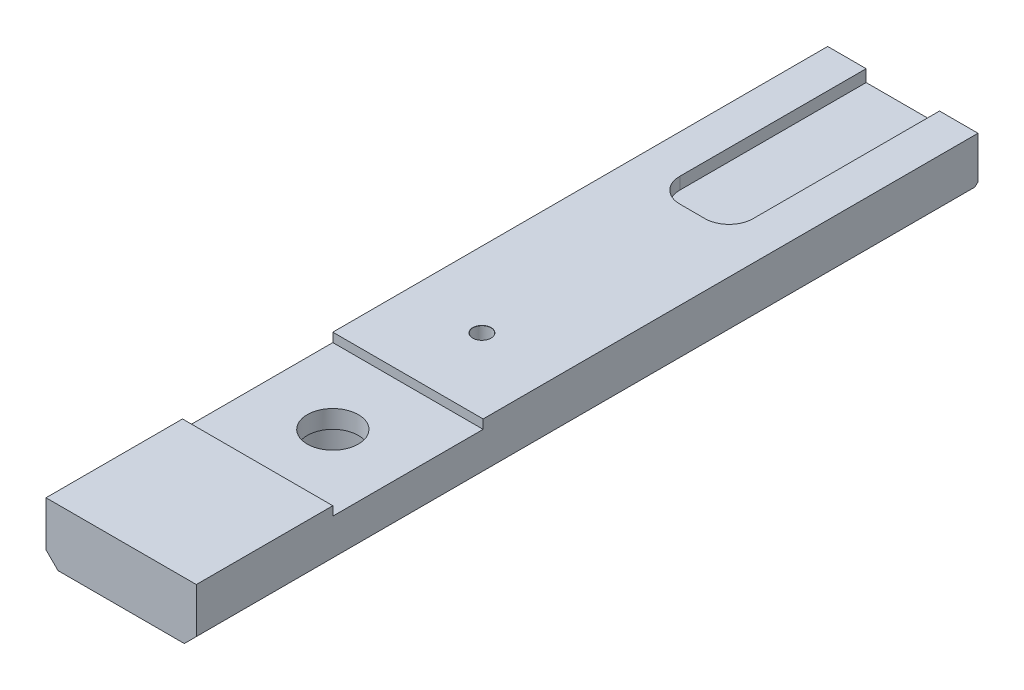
ISO-10303-21;
HEADER;
FILE_DESCRIPTION(('STEP AP214'),'2;1');
FILE_NAME('part.step','',(''),(''),'','','');
FILE_SCHEMA(('AUTOMOTIVE_DESIGN { 1 0 10303 214 1 1 1 1 }'));
ENDSEC;
DATA;
#1=APPLICATION_CONTEXT('core data for automotive mechanical design processes');
#2=APPLICATION_PROTOCOL_DEFINITION('international standard','automotive_design',2000,#1);
#3=PRODUCT_CONTEXT('',#1,'mechanical');
#4=PRODUCT('Part','Part','',(#3));
#5=PRODUCT_RELATED_PRODUCT_CATEGORY('part','',(#4));
#6=PRODUCT_DEFINITION_FORMATION('','',#4);
#7=PRODUCT_DEFINITION_CONTEXT('part definition',#1,'design');
#8=PRODUCT_DEFINITION('design','',#6,#7);
#9=PRODUCT_DEFINITION_SHAPE('','',#8);
#10=(LENGTH_UNIT() NAMED_UNIT(*) SI_UNIT(.MILLI.,.METRE.));
#11=(NAMED_UNIT(*) PLANE_ANGLE_UNIT() SI_UNIT($,.RADIAN.));
#12=(NAMED_UNIT(*) SI_UNIT($,.STERADIAN.) SOLID_ANGLE_UNIT());
#13=UNCERTAINTY_MEASURE_WITH_UNIT(LENGTH_MEASURE(1.E-05),#10,'distance_accuracy_value','');
#14=(GEOMETRIC_REPRESENTATION_CONTEXT(3) GLOBAL_UNCERTAINTY_ASSIGNED_CONTEXT((#13)) GLOBAL_UNIT_ASSIGNED_CONTEXT((#10,
#11,#12)) REPRESENTATION_CONTEXT('',''));
#15=CARTESIAN_POINT('',(0.,0.,0.));
#16=DIRECTION('',(0.,0.,1.));
#17=DIRECTION('',(1.,0.,0.));
#18=AXIS2_PLACEMENT_3D('',#15,#16,#17);
#19=CARTESIAN_POINT('',(-6.09999999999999,0.,130.));
#20=DIRECTION('',(-1.,0.,0.));
#21=DIRECTION('',(0.,0.,1.));
#22=AXIS2_PLACEMENT_3D('',#19,#20,#21);
#23=PLANE('',#22);
#24=DIRECTION('',(0.,0.,-1.));
#25=VECTOR('',#24,1.);
#26=CARTESIAN_POINT('',(-6.09999999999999,1.5,130.));
#27=LINE('',#26,#25);
#28=CARTESIAN_POINT('',(-6.10000000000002,1.49999999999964,91.3663430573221));
#29=VERTEX_POINT('',#28);
#30=CARTESIAN_POINT('',(-6.09999999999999,1.5,3.));
#31=VERTEX_POINT('',#30);
#32=EDGE_CURVE('E464',#29,#31,#27,.T.);
#33=ORIENTED_EDGE('',*,*,#32,.F.);
#34=DIRECTION('',(0.,-1.,0.));
#35=VECTOR('',#34,1.);
#36=CARTESIAN_POINT('',(-6.10000000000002,6.99999999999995,91.3663430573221));
#37=LINE('',#36,#35);
#38=CARTESIAN_POINT('',(-6.10000000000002,0.499999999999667,91.3663430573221));
#39=VERTEX_POINT('',#38);
#40=EDGE_CURVE('E313',#29,#39,#37,.T.);
#41=ORIENTED_EDGE('',*,*,#40,.T.);
#42=DIRECTION('',(0.,0.,-1.));
#43=VECTOR('',#42,1.);
#44=CARTESIAN_POINT('',(-6.09999999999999,0.5,130.));
#45=LINE('',#44,#43);
#46=CARTESIAN_POINT('',(-6.09999999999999,0.500000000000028,3.99999999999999));
#47=VERTEX_POINT('',#46);
#48=EDGE_CURVE('E469',#39,#47,#45,.T.);
#49=ORIENTED_EDGE('',*,*,#48,.T.);
#50=DIRECTION('',(0.,0.707106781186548,-0.707106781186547));
#51=VECTOR('',#50,1.);
#52=CARTESIAN_POINT('',(-6.10000000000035,-62.75,67.25));
#53=LINE('',#52,#51);
#54=EDGE_CURVE('E369',#47,#31,#53,.T.);
#55=ORIENTED_EDGE('',*,*,#54,.T.);
#56=EDGE_LOOP('',(#33,#41,#49,#55));
#57=FACE_BOUND('',#56,.T.);
#58=ADVANCED_FACE('F44',(#57),#23,.F.);
#59=CARTESIAN_POINT('',(-6.09999999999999,1.5,130.));
#60=DIRECTION('',(0.,1.,0.));
#61=DIRECTION('',(-1.,0.,0.));
#62=AXIS2_PLACEMENT_3D('',#59,#60,#61);
#63=PLANE('',#62);
#64=CARTESIAN_POINT('',(-6.09999999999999,1.5,129.5));
#65=VERTEX_POINT('',#64);
#66=CARTESIAN_POINT('',(-6.10000000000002,1.49999999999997,98.2336569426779));
#67=VERTEX_POINT('',#66);
#68=EDGE_CURVE('E465',#65,#67,#27,.T.);
#69=ORIENTED_EDGE('',*,*,#68,.T.);
#70=CARTESIAN_POINT('',(0.,1.49999999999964,94.8));
#71=DIRECTION('',(0.,1.,0.));
#72=DIRECTION('',(-1.,0.,0.));
#73=AXIS2_PLACEMENT_3D('',#70,#71,#72);
#74=CIRCLE('',#73,7.00000000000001);
#75=CARTESIAN_POINT('',(6.09999999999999,1.49999999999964,98.2336569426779));
#76=VERTEX_POINT('',#75);
#77=EDGE_CURVE('E314',#67,#76,#74,.T.);
#78=ORIENTED_EDGE('',*,*,#77,.T.);
#79=DIRECTION('',(0.,0.,-1.));
#80=VECTOR('',#79,1.);
#81=CARTESIAN_POINT('',(6.09999999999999,1.5,130.));
#82=LINE('',#81,#80);
#83=CARTESIAN_POINT('',(6.09999999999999,1.5,129.5));
#84=VERTEX_POINT('',#83);
#85=EDGE_CURVE('E460',#84,#76,#82,.T.);
#86=ORIENTED_EDGE('',*,*,#85,.F.);
#87=DIRECTION('',(-1.,0.,0.));
#88=VECTOR('',#87,1.);
#89=CARTESIAN_POINT('',(-6.09999999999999,1.5,129.5));
#90=LINE('',#89,#88);
#91=EDGE_CURVE('E381',#84,#65,#90,.T.);
#92=ORIENTED_EDGE('',*,*,#91,.T.);
#93=EDGE_LOOP('',(#69,#78,#86,#92));
#94=FACE_BOUND('',#93,.T.);
#95=ADVANCED_FACE('F574',(#94),#63,.F.);
#96=CARTESIAN_POINT('',(6.09999999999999,1.5,130.));
#97=DIRECTION('',(1.,0.,0.));
#98=DIRECTION('',(0.,0.,-1.));
#99=AXIS2_PLACEMENT_3D('',#96,#97,#98);
#100=PLANE('',#99);
#101=ORIENTED_EDGE('',*,*,#85,.T.);
#102=DIRECTION('',(0.,-1.,0.));
#103=VECTOR('',#102,1.);
#104=CARTESIAN_POINT('',(6.09999999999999,6.99999999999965,98.2336569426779));
#105=LINE('',#104,#103);
#106=CARTESIAN_POINT('',(6.09999999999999,0.49999999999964,98.2336569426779));
#107=VERTEX_POINT('',#106);
#108=EDGE_CURVE('E321',#76,#107,#105,.T.);
#109=ORIENTED_EDGE('',*,*,#108,.T.);
#110=DIRECTION('',(0.,0.,1.));
#111=VECTOR('',#110,1.);
#112=CARTESIAN_POINT('',(6.09999999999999,0.5,130.));
#113=LINE('',#112,#111);
#114=CARTESIAN_POINT('',(6.09999999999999,0.5,128.5));
#115=VERTEX_POINT('',#114);
#116=EDGE_CURVE('E484',#107,#115,#113,.T.);
#117=ORIENTED_EDGE('',*,*,#116,.T.);
#118=DIRECTION('',(0.,0.707106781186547,0.707106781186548));
#119=VECTOR('',#118,1.);
#120=CARTESIAN_POINT('',(6.09999999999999,1.75,129.75));
#121=LINE('',#120,#119);
#122=EDGE_CURVE('E377',#115,#84,#121,.T.);
#123=ORIENTED_EDGE('',*,*,#122,.T.);
#124=EDGE_LOOP('',(#101,#109,#117,#123));
#125=FACE_BOUND('',#124,.T.);
#126=ADVANCED_FACE('F581',(#125),#100,.F.);
#127=CARTESIAN_POINT('',(-6.09999999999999,0.5,130.));
#128=DIRECTION('',(-0.707106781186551,0.707106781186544,0.));
#129=DIRECTION('',(-0.707106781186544,-0.707106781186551,0.));
#130=AXIS2_PLACEMENT_3D('',#127,#128,#129);
#131=PLANE('',#130);
#132=CARTESIAN_POINT('',(0.,6.59999999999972,94.8));
#133=DIRECTION('',(-0.707106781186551,0.707106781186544,0.));
#134=DIRECTION('',(-0.707106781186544,-0.707106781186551,0.));
#135=AXIS2_PLACEMENT_3D('',#132,#133,#134);
#136=ELLIPSE('',#135,9.89949493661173,7.00000000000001);
#137=CARTESIAN_POINT('',(-6.60000000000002,-3.60822483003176E-13,92.4676192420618));
#138=VERTEX_POINT('',#137);
#139=EDGE_CURVE('E318',#138,#39,#136,.F.);
#140=ORIENTED_EDGE('',*,*,#139,.F.);
#141=DIRECTION('',(0.,0.,1.));
#142=VECTOR('',#141,1.);
#143=CARTESIAN_POINT('',(-6.59999999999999,0.,130.));
#144=LINE('',#143,#142);
#145=CARTESIAN_POINT('',(-6.59999999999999,0.,4.49999999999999));
#146=VERTEX_POINT('',#145);
#147=EDGE_CURVE('E475',#146,#138,#144,.T.);
#148=ORIENTED_EDGE('',*,*,#147,.F.);
#149=DIRECTION('',(0.577350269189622,0.577350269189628,-0.577350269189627));
#150=VECTOR('',#149,1.);
#151=CARTESIAN_POINT('',(-48.1,-41.500000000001,46.0000000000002));
#152=LINE('',#151,#150);
#153=EDGE_CURVE('E373',#47,#146,#152,.F.);
#154=ORIENTED_EDGE('',*,*,#153,.F.);
#155=ORIENTED_EDGE('',*,*,#48,.F.);
#156=EDGE_LOOP('',(#140,#148,#154,#155));
#157=FACE_BOUND('',#156,.T.);
#158=ADVANCED_FACE('F745',(#157),#131,.F.);
#159=CARTESIAN_POINT('',(6.59999999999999,0.,130.));
#160=DIRECTION('',(0.707106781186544,0.707106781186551,0.));
#161=DIRECTION('',(-0.707106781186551,0.707106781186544,0.));
#162=AXIS2_PLACEMENT_3D('',#159,#160,#161);
#163=PLANE('',#162);
#164=CARTESIAN_POINT('',(0.,6.59999999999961,94.8));
#165=DIRECTION('',(0.707106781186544,0.707106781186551,0.));
#166=DIRECTION('',(0.707106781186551,-0.707106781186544,0.));
#167=AXIS2_PLACEMENT_3D('',#164,#165,#166);
#168=ELLIPSE('',#167,9.89949493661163,7.00000000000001);
#169=CARTESIAN_POINT('',(6.59999999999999,-3.60822483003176E-13,97.1323807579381));
#170=VERTEX_POINT('',#169);
#171=EDGE_CURVE('E501',#170,#107,#168,.F.);
#172=ORIENTED_EDGE('',*,*,#171,.F.);
#173=DIRECTION('',(0.,0.,-1.));
#174=VECTOR('',#173,1.);
#175=CARTESIAN_POINT('',(6.59999999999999,0.,130.));
#176=LINE('',#175,#174);
#177=CARTESIAN_POINT('',(6.59999999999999,0.,128.));
#178=VERTEX_POINT('',#177);
#179=EDGE_CURVE('E480',#178,#170,#176,.T.);
#180=ORIENTED_EDGE('',*,*,#179,.F.);
#181=DIRECTION('',(-0.57735026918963,0.577350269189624,0.577350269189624));
#182=VECTOR('',#181,1.);
#183=CARTESIAN_POINT('',(5.93333333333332,0.666666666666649,128.666666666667));
#184=LINE('',#183,#182);
#185=EDGE_CURVE('E492',#115,#178,#184,.F.);
#186=ORIENTED_EDGE('',*,*,#185,.F.);
#187=ORIENTED_EDGE('',*,*,#116,.F.);
#188=EDGE_LOOP('',(#172,#180,#186,#187));
#189=FACE_BOUND('',#188,.T.);
#190=ADVANCED_FACE('F786',(#189),#163,.F.);
#191=CARTESIAN_POINT('',(0.,-3.60822483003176E-13,94.8));
#192=DIRECTION('',(0.,1.,0.));
#193=DIRECTION('',(0.,0.,1.));
#194=AXIS2_PLACEMENT_3D('',#191,#192,#193);
#195=CYLINDRICAL_SURFACE('',#194,4.25000000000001);
#196=CARTESIAN_POINT('',(0.,10.,94.8));
#197=DIRECTION('',(0.,1.,0.));
#198=DIRECTION('',(0.,0.,1.));
#199=AXIS2_PLACEMENT_3D('',#196,#197,#198);
#200=CIRCLE('',#199,4.25000000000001);
#201=CARTESIAN_POINT('',(0.,10.,99.05));
#202=VERTEX_POINT('',#201);
#203=EDGE_CURVE('E334',#202,#202,#200,.T.);
#204=ORIENTED_EDGE('',*,*,#203,.T.);
#205=EDGE_LOOP('',(#204));
#206=FACE_BOUND('',#205,.T.);
#207=CARTESIAN_POINT('',(0.,6.99999999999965,94.8));
#208=DIRECTION('',(0.,-1.,0.));
#209=DIRECTION('',(0.,0.,-1.));
#210=AXIS2_PLACEMENT_3D('',#207,#208,#209);
#211=CIRCLE('',#210,4.25000000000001);
#212=CARTESIAN_POINT('',(0.,6.99999999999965,90.55));
#213=VERTEX_POINT('',#212);
#214=EDGE_CURVE('E300',#213,#213,#211,.F.);
#215=ORIENTED_EDGE('',*,*,#214,.F.);
#216=EDGE_LOOP('',(#215));
#217=FACE_BOUND('',#216,.T.);
#218=ADVANCED_FACE('F793',(#206,#217),#195,.F.);
#219=CARTESIAN_POINT('',(-12.5,11.5,130.));
#220=DIRECTION('',(0.,-1.,0.));
#221=DIRECTION('',(1.,0.,0.));
#222=AXIS2_PLACEMENT_3D('',#219,#220,#221);
#223=PLANE('',#222);
#224=DIRECTION('',(0.,0.,-1.));
#225=VECTOR('',#224,1.);
#226=CARTESIAN_POINT('',(12.5,11.5,130.));
#227=LINE('',#226,#225);
#228=CARTESIAN_POINT('',(12.5,11.5,130.));
#229=VERTEX_POINT('',#228);
#230=CARTESIAN_POINT('',(12.5,11.5,107.3));
#231=VERTEX_POINT('',#230);
#232=EDGE_CURVE('E455',#229,#231,#227,.T.);
#233=ORIENTED_EDGE('',*,*,#232,.T.);
#234=DIRECTION('',(1.,0.,0.));
#235=VECTOR('',#234,1.);
#236=CARTESIAN_POINT('',(-12.5000000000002,11.5,107.3));
#237=LINE('',#236,#235);
#238=CARTESIAN_POINT('',(-12.5000000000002,11.5,107.3));
#239=VERTEX_POINT('',#238);
#240=EDGE_CURVE('E416',#239,#231,#237,.T.);
#241=ORIENTED_EDGE('',*,*,#240,.F.);
#242=DIRECTION('',(0.,0.,-1.));
#243=VECTOR('',#242,1.);
#244=CARTESIAN_POINT('',(-12.5,11.5,130.));
#245=LINE('',#244,#243);
#246=CARTESIAN_POINT('',(-12.5,11.5,130.));
#247=VERTEX_POINT('',#246);
#248=EDGE_CURVE('E450',#247,#239,#245,.T.);
#249=ORIENTED_EDGE('',*,*,#248,.F.);
#250=DIRECTION('',(-1.,0.,0.));
#251=VECTOR('',#250,1.);
#252=CARTESIAN_POINT('',(-12.5,11.5,130.));
#253=LINE('',#252,#251);
#254=EDGE_CURVE('E437',#229,#247,#253,.T.);
#255=ORIENTED_EDGE('',*,*,#254,.F.);
#256=EDGE_LOOP('',(#233,#241,#249,#255));
#257=FACE_BOUND('',#256,.T.);
#258=ADVANCED_FACE('F756',(#257),#223,.F.);
#259=CARTESIAN_POINT('',(-12.5,0.,130.));
#260=DIRECTION('',(1.,0.,0.));
#261=DIRECTION('',(0.,1.,0.));
#262=AXIS2_PLACEMENT_3D('',#259,#260,#261);
#263=PLANE('',#262);
#264=DIRECTION('',(0.,-0.707106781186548,0.707106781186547));
#265=VECTOR('',#264,1.);
#266=CARTESIAN_POINT('',(-12.5000000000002,4.5,0.));
#267=LINE('',#266,#265);
#268=CARTESIAN_POINT('',(-12.5000000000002,4.5,0.));
#269=VERTEX_POINT('',#268);
#270=CARTESIAN_POINT('',(-12.5000000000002,4.,0.5));
#271=VERTEX_POINT('',#270);
#272=EDGE_CURVE('E348',#269,#271,#267,.T.);
#273=ORIENTED_EDGE('',*,*,#272,.T.);
#274=DIRECTION('',(0.,0.,1.));
#275=VECTOR('',#274,1.);
#276=CARTESIAN_POINT('',(-12.5,4.,130.));
#277=LINE('',#276,#275);
#278=CARTESIAN_POINT('',(-12.5,4.,130.));
#279=VERTEX_POINT('',#278);
#280=EDGE_CURVE('E531',#271,#279,#277,.T.);
#281=ORIENTED_EDGE('',*,*,#280,.T.);
#282=DIRECTION('',(0.,-1.,0.));
#283=VECTOR('',#282,1.);
#284=CARTESIAN_POINT('',(-12.5,0.,130.));
#285=LINE('',#284,#283);
#286=EDGE_CURVE('E429',#247,#279,#285,.T.);
#287=ORIENTED_EDGE('',*,*,#286,.F.);
#288=ORIENTED_EDGE('',*,*,#248,.T.);
#289=DIRECTION('',(0.,-1.,0.));
#290=VECTOR('',#289,1.);
#291=CARTESIAN_POINT('',(-12.5000000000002,11.5,107.3));
#292=LINE('',#291,#290);
#293=CARTESIAN_POINT('',(-12.5000000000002,9.99999999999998,107.3));
#294=VERTEX_POINT('',#293);
#295=EDGE_CURVE('E393',#239,#294,#292,.T.);
#296=ORIENTED_EDGE('',*,*,#295,.T.);
#297=DIRECTION('',(0.,0.,-1.));
#298=VECTOR('',#297,1.);
#299=CARTESIAN_POINT('',(-12.5000000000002,9.99999999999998,107.3));
#300=LINE('',#299,#298);
#301=CARTESIAN_POINT('',(-12.5000000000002,9.99999999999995,82.3));
#302=VERTEX_POINT('',#301);
#303=EDGE_CURVE('E397',#294,#302,#300,.T.);
#304=ORIENTED_EDGE('',*,*,#303,.T.);
#305=DIRECTION('',(0.,1.,0.));
#306=VECTOR('',#305,1.);
#307=CARTESIAN_POINT('',(-12.5000000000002,9.99999999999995,82.3));
#308=LINE('',#307,#306);
#309=CARTESIAN_POINT('',(-12.5000000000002,11.5,82.3));
#310=VERTEX_POINT('',#309);
#311=EDGE_CURVE('E402',#302,#310,#308,.T.);
#312=ORIENTED_EDGE('',*,*,#311,.T.);
#313=CARTESIAN_POINT('',(-12.5000000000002,11.5,0.));
#314=VERTEX_POINT('',#313);
#315=EDGE_CURVE('E440',#310,#314,#245,.T.);
#316=ORIENTED_EDGE('',*,*,#315,.T.);
#317=DIRECTION('',(0.,-1.,0.));
#318=VECTOR('',#317,1.);
#319=CARTESIAN_POINT('',(-12.5000000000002,0.,0.));
#320=LINE('',#319,#318);
#321=EDGE_CURVE('E419',#314,#269,#320,.T.);
#322=ORIENTED_EDGE('',*,*,#321,.T.);
#323=EDGE_LOOP('',(#273,#281,#287,#288,#296,#304,#312,#316,#322));
#324=FACE_BOUND('',#323,.T.);
#325=ADVANCED_FACE('F594',(#324),#263,.F.);
#326=CARTESIAN_POINT('',(-12.5,0.,130.));
#327=DIRECTION('',(0.,1.,0.));
#328=DIRECTION('',(0.,0.,1.));
#329=AXIS2_PLACEMENT_3D('',#326,#327,#328);
#330=PLANE('',#329);
#331=DIRECTION('',(1.,0.,0.));
#332=VECTOR('',#331,1.);
#333=CARTESIAN_POINT('',(-12.5,0.,128.));
#334=LINE('',#333,#332);
#335=CARTESIAN_POINT('',(-8.50000000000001,0.,128.));
#336=VERTEX_POINT('',#335);
#337=CARTESIAN_POINT('',(-6.59999999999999,0.,128.));
#338=VERTEX_POINT('',#337);
#339=EDGE_CURVE('E344',#336,#338,#334,.T.);
#340=ORIENTED_EDGE('',*,*,#339,.F.);
#341=DIRECTION('',(0.,0.,-1.));
#342=VECTOR('',#341,1.);
#343=CARTESIAN_POINT('',(-8.50000000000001,0.,130.));
#344=LINE('',#343,#342);
#345=CARTESIAN_POINT('',(-8.50000000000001,0.,4.5));
#346=VERTEX_POINT('',#345);
#347=EDGE_CURVE('E527',#336,#346,#344,.T.);
#348=ORIENTED_EDGE('',*,*,#347,.T.);
#349=DIRECTION('',(1.,0.,0.));
#350=VECTOR('',#349,1.);
#351=CARTESIAN_POINT('',(-12.5000000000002,0.,4.5));
#352=LINE('',#351,#350);
#353=EDGE_CURVE('E356',#346,#146,#352,.T.);
#354=ORIENTED_EDGE('',*,*,#353,.T.);
#355=ORIENTED_EDGE('',*,*,#147,.T.);
#356=CARTESIAN_POINT('',(0.,-3.60822483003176E-13,94.8));
#357=DIRECTION('',(0.,1.,0.));
#358=DIRECTION('',(0.,0.,1.));
#359=AXIS2_PLACEMENT_3D('',#356,#357,#358);
#360=CIRCLE('',#359,7.00000000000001);
#361=CARTESIAN_POINT('',(-6.60000000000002,0.,97.1323807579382));
#362=VERTEX_POINT('',#361);
#363=EDGE_CURVE('E330',#138,#362,#360,.T.);
#364=ORIENTED_EDGE('',*,*,#363,.T.);
#365=EDGE_CURVE('E474',#362,#338,#144,.T.);
#366=ORIENTED_EDGE('',*,*,#365,.T.);
#367=EDGE_LOOP('',(#340,#348,#354,#355,#364,#366));
#368=FACE_BOUND('',#367,.T.);
#369=ADVANCED_FACE('F587',(#368),#330,.F.);
#370=CARTESIAN_POINT('',(-6.09999999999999,0.5,128.5));
#371=VERTEX_POINT('',#370);
#372=CARTESIAN_POINT('',(-6.10000000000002,0.5,98.2336569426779));
#373=VERTEX_POINT('',#372);
#374=EDGE_CURVE('E470',#371,#373,#45,.T.);
#375=ORIENTED_EDGE('',*,*,#374,.T.);
#376=DIRECTION('',(0.,-1.,0.));
#377=VECTOR('',#376,1.);
#378=CARTESIAN_POINT('',(-6.10000000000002,6.99999999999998,98.2336569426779));
#379=LINE('',#378,#377);
#380=EDGE_CURVE('E326',#373,#67,#379,.F.);
#381=ORIENTED_EDGE('',*,*,#380,.T.);
#382=ORIENTED_EDGE('',*,*,#68,.F.);
#383=DIRECTION('',(0.,-0.707106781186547,-0.707106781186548));
#384=VECTOR('',#383,1.);
#385=CARTESIAN_POINT('',(-6.09999999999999,1.,129.));
#386=LINE('',#385,#384);
#387=EDGE_CURVE('E385',#65,#371,#386,.T.);
#388=ORIENTED_EDGE('',*,*,#387,.T.);
#389=EDGE_LOOP('',(#375,#381,#382,#388));
#390=FACE_BOUND('',#389,.T.);
#391=ADVANCED_FACE('F577',(#390),#23,.F.);
#392=CARTESIAN_POINT('',(-3.60822483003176E-13,1.49999999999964,70.));
#393=DIRECTION('',(0.,1.,0.));
#394=DIRECTION('',(-1.,0.,0.));
#395=AXIS2_PLACEMENT_3D('',#392,#393,#394);
#396=CIRCLE('',#395,2.3);
#397=CARTESIAN_POINT('',(-2.30000000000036,1.49999999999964,70.));
#398=VERTEX_POINT('',#397);
#399=EDGE_CURVE('E54',#398,#398,#396,.T.);
#400=ORIENTED_EDGE('',*,*,#399,.T.);
#401=EDGE_LOOP('',(#400));
#402=FACE_BOUND('',#401,.T.);
#403=CARTESIAN_POINT('',(6.09999999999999,1.49999999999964,91.3663430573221));
#404=VERTEX_POINT('',#403);
#405=CARTESIAN_POINT('',(6.09999999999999,1.5,3.));
#406=VERTEX_POINT('',#405);
#407=EDGE_CURVE('E459',#404,#406,#82,.T.);
#408=ORIENTED_EDGE('',*,*,#407,.F.);
#409=EDGE_CURVE('E309',#404,#29,#74,.T.);
#410=ORIENTED_EDGE('',*,*,#409,.T.);
#411=ORIENTED_EDGE('',*,*,#32,.T.);
#412=DIRECTION('',(1.,0.,0.));
#413=VECTOR('',#412,1.);
#414=CARTESIAN_POINT('',(-6.09999999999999,1.5,3.));
#415=LINE('',#414,#413);
#416=EDGE_CURVE('E365',#31,#406,#415,.T.);
#417=ORIENTED_EDGE('',*,*,#416,.T.);
#418=EDGE_LOOP('',(#408,#410,#411,#417));
#419=FACE_BOUND('',#418,.T.);
#420=ADVANCED_FACE('F561',(#402,#419),#63,.F.);
#421=CARTESIAN_POINT('',(6.09999999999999,0.5,3.99999999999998));
#422=VERTEX_POINT('',#421);
#423=CARTESIAN_POINT('',(6.09999999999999,0.49999999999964,91.3663430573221));
#424=VERTEX_POINT('',#423);
#425=EDGE_CURVE('E485',#422,#424,#113,.T.);
#426=ORIENTED_EDGE('',*,*,#425,.T.);
#427=DIRECTION('',(0.,-1.,0.));
#428=VECTOR('',#427,1.);
#429=CARTESIAN_POINT('',(6.09999999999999,6.99999999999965,91.3663430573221));
#430=LINE('',#429,#428);
#431=EDGE_CURVE('E305',#424,#404,#430,.F.);
#432=ORIENTED_EDGE('',*,*,#431,.T.);
#433=ORIENTED_EDGE('',*,*,#407,.T.);
#434=DIRECTION('',(0.,-0.707106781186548,0.707106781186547));
#435=VECTOR('',#434,1.);
#436=CARTESIAN_POINT('',(6.09999999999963,-62.0000000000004,66.5));
#437=LINE('',#436,#435);
#438=EDGE_CURVE('E343',#406,#422,#437,.T.);
#439=ORIENTED_EDGE('',*,*,#438,.T.);
#440=EDGE_LOOP('',(#426,#432,#433,#439));
#441=FACE_BOUND('',#440,.T.);
#442=ADVANCED_FACE('F593',(#441),#100,.F.);
#443=CARTESIAN_POINT('',(6.09999999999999,0.,130.));
#444=DIRECTION('',(0.,1.,0.));
#445=DIRECTION('',(-1.,0.,0.));
#446=AXIS2_PLACEMENT_3D('',#443,#444,#445);
#447=PLANE('',#446);
#448=CARTESIAN_POINT('',(6.60000000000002,0.,4.49999999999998));
#449=VERTEX_POINT('',#448);
#450=CARTESIAN_POINT('',(8.49999999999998,0.,4.49999999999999));
#451=VERTEX_POINT('',#450);
#452=EDGE_CURVE('E359',#449,#451,#352,.T.);
#453=ORIENTED_EDGE('',*,*,#452,.T.);
#454=DIRECTION('',(0.,0.,1.));
#455=VECTOR('',#454,1.);
#456=CARTESIAN_POINT('',(8.49999999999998,0.,130.));
#457=LINE('',#456,#455);
#458=CARTESIAN_POINT('',(8.49999999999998,0.,128.));
#459=VERTEX_POINT('',#458);
#460=EDGE_CURVE('E512',#451,#459,#457,.T.);
#461=ORIENTED_EDGE('',*,*,#460,.T.);
#462=EDGE_CURVE('E347',#178,#459,#334,.T.);
#463=ORIENTED_EDGE('',*,*,#462,.F.);
#464=ORIENTED_EDGE('',*,*,#179,.T.);
#465=CARTESIAN_POINT('',(0.,-3.60822483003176E-13,94.8));
#466=DIRECTION('',(0.,1.,0.));
#467=DIRECTION('',(-1.,0.,0.));
#468=AXIS2_PLACEMENT_3D('',#465,#466,#467);
#469=CIRCLE('',#468,7.00000000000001);
#470=CARTESIAN_POINT('',(6.59999999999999,-3.60822483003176E-13,92.4676192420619));
#471=VERTEX_POINT('',#470);
#472=EDGE_CURVE('E301',#170,#471,#469,.T.);
#473=ORIENTED_EDGE('',*,*,#472,.T.);
#474=EDGE_CURVE('E479',#471,#449,#176,.T.);
#475=ORIENTED_EDGE('',*,*,#474,.T.);
#476=EDGE_LOOP('',(#453,#461,#463,#464,#473,#475));
#477=FACE_BOUND('',#476,.T.);
#478=ADVANCED_FACE('F696',(#477),#447,.F.);
#479=CARTESIAN_POINT('',(12.5,11.5,130.));
#480=DIRECTION('',(-1.,0.,0.));
#481=DIRECTION('',(0.,-1.,0.));
#482=AXIS2_PLACEMENT_3D('',#479,#480,#481);
#483=PLANE('',#482);
#484=DIRECTION('',(0.,1.,0.));
#485=VECTOR('',#484,1.);
#486=CARTESIAN_POINT('',(12.5,11.5,130.));
#487=LINE('',#486,#485);
#488=CARTESIAN_POINT('',(12.5,3.99999999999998,130.));
#489=VERTEX_POINT('',#488);
#490=EDGE_CURVE('E433',#489,#229,#487,.T.);
#491=ORIENTED_EDGE('',*,*,#490,.F.);
#492=DIRECTION('',(0.,0.,-1.));
#493=VECTOR('',#492,1.);
#494=CARTESIAN_POINT('',(12.5,3.99999999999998,130.));
#495=LINE('',#494,#493);
#496=CARTESIAN_POINT('',(12.5,3.99999999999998,0.500000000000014));
#497=VERTEX_POINT('',#496);
#498=EDGE_CURVE('E502',#489,#497,#495,.T.);
#499=ORIENTED_EDGE('',*,*,#498,.T.);
#500=DIRECTION('',(0.,-0.707106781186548,0.707106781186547));
#501=VECTOR('',#500,1.);
#502=CARTESIAN_POINT('',(12.5,4.5,0.));
#503=LINE('',#502,#501);
#504=CARTESIAN_POINT('',(12.5,4.5,0.));
#505=VERTEX_POINT('',#504);
#506=EDGE_CURVE('E338',#505,#497,#503,.T.);
#507=ORIENTED_EDGE('',*,*,#506,.F.);
#508=DIRECTION('',(0.,1.,0.));
#509=VECTOR('',#508,1.);
#510=CARTESIAN_POINT('',(12.5,11.5,0.));
#511=LINE('',#510,#509);
#512=CARTESIAN_POINT('',(12.5,11.5,0.));
#513=VERTEX_POINT('',#512);
#514=EDGE_CURVE('E444',#505,#513,#511,.T.);
#515=ORIENTED_EDGE('',*,*,#514,.T.);
#516=CARTESIAN_POINT('',(12.5,11.4999999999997,82.3));
#517=VERTEX_POINT('',#516);
#518=EDGE_CURVE('E454',#517,#513,#227,.T.);
#519=ORIENTED_EDGE('',*,*,#518,.F.);
#520=DIRECTION('',(0.,1.,0.));
#521=VECTOR('',#520,1.);
#522=CARTESIAN_POINT('',(12.5,9.99999999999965,82.3));
#523=LINE('',#522,#521);
#524=CARTESIAN_POINT('',(12.5,9.99999999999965,82.3));
#525=VERTEX_POINT('',#524);
#526=EDGE_CURVE('E398',#525,#517,#523,.T.);
#527=ORIENTED_EDGE('',*,*,#526,.F.);
#528=DIRECTION('',(0.,0.,-1.));
#529=VECTOR('',#528,1.);
#530=CARTESIAN_POINT('',(12.5,9.99999999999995,107.3));
#531=LINE('',#530,#529);
#532=CARTESIAN_POINT('',(12.5,9.99999999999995,107.3));
#533=VERTEX_POINT('',#532);
#534=EDGE_CURVE('E410',#533,#525,#531,.T.);
#535=ORIENTED_EDGE('',*,*,#534,.F.);
#536=DIRECTION('',(0.,-1.,0.));
#537=VECTOR('',#536,1.);
#538=CARTESIAN_POINT('',(12.5,11.5,107.3));
#539=LINE('',#538,#537);
#540=EDGE_CURVE('E392',#231,#533,#539,.T.);
#541=ORIENTED_EDGE('',*,*,#540,.F.);
#542=ORIENTED_EDGE('',*,*,#232,.F.);
#543=EDGE_LOOP('',(#491,#499,#507,#515,#519,#527,#535,#541,#542));
#544=FACE_BOUND('',#543,.T.);
#545=ADVANCED_FACE('F749',(#544),#483,.F.);
#546=DIRECTION('',(-1.,0.,0.));
#547=VECTOR('',#546,1.);
#548=CARTESIAN_POINT('',(-12.5000000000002,11.5,0.));
#549=LINE('',#548,#547);
#550=CARTESIAN_POINT('',(6.09999999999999,11.5,0.));
#551=VERTEX_POINT('',#550);
#552=EDGE_CURVE('E434',#513,#551,#549,.T.);
#553=ORIENTED_EDGE('',*,*,#552,.T.);
#554=DIRECTION('',(0.,0.,-1.));
#555=VECTOR('',#554,1.);
#556=CARTESIAN_POINT('',(6.09999999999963,11.4999999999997,35.));
#557=LINE('',#556,#555);
#558=CARTESIAN_POINT('',(6.09999999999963,11.4999999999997,31.));
#559=VERTEX_POINT('',#558);
#560=EDGE_CURVE('E281',#559,#551,#557,.T.);
#561=ORIENTED_EDGE('',*,*,#560,.F.);
#562=CARTESIAN_POINT('',(2.09999999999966,11.4999999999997,31.));
#563=DIRECTION('',(0.,-1.,0.));
#564=DIRECTION('',(1.,0.,0.));
#565=AXIS2_PLACEMENT_3D('',#562,#563,#564);
#566=CIRCLE('',#565,4.);
#567=CARTESIAN_POINT('',(2.09999999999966,11.4999999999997,35.));
#568=VERTEX_POINT('',#567);
#569=EDGE_CURVE('E552',#559,#568,#566,.T.);
#570=ORIENTED_EDGE('',*,*,#569,.T.);
#571=DIRECTION('',(1.,0.,0.));
#572=VECTOR('',#571,1.);
#573=CARTESIAN_POINT('',(6.09999999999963,11.4999999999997,35.));
#574=LINE('',#573,#572);
#575=CARTESIAN_POINT('',(-2.10000000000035,11.4999999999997,35.));
#576=VERTEX_POINT('',#575);
#577=EDGE_CURVE('E277',#576,#568,#574,.T.);
#578=ORIENTED_EDGE('',*,*,#577,.F.);
#579=CARTESIAN_POINT('',(-2.10000000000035,11.4999999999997,31.));
#580=DIRECTION('',(0.,-1.,0.));
#581=DIRECTION('',(1.,0.,0.));
#582=AXIS2_PLACEMENT_3D('',#579,#580,#581);
#583=CIRCLE('',#582,4.);
#584=CARTESIAN_POINT('',(-6.10000000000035,11.4999999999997,31.));
#585=VERTEX_POINT('',#584);
#586=EDGE_CURVE('E61',#576,#585,#583,.T.);
#587=ORIENTED_EDGE('',*,*,#586,.T.);
#588=DIRECTION('',(0.,0.,-1.));
#589=VECTOR('',#588,1.);
#590=CARTESIAN_POINT('',(-6.10000000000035,11.4999999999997,35.));
#591=LINE('',#590,#589);
#592=CARTESIAN_POINT('',(-6.09999999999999,11.5,0.));
#593=VERTEX_POINT('',#592);
#594=EDGE_CURVE('E255',#585,#593,#591,.T.);
#595=ORIENTED_EDGE('',*,*,#594,.T.);
#596=EDGE_CURVE('E270',#593,#314,#549,.T.);
#597=ORIENTED_EDGE('',*,*,#596,.T.);
#598=ORIENTED_EDGE('',*,*,#315,.F.);
#599=DIRECTION('',(1.,0.,0.));
#600=VECTOR('',#599,1.);
#601=CARTESIAN_POINT('',(-12.5000000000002,11.5,82.3));
#602=LINE('',#601,#600);
#603=EDGE_CURVE('E420',#310,#517,#602,.T.);
#604=ORIENTED_EDGE('',*,*,#603,.T.);
#605=ORIENTED_EDGE('',*,*,#518,.T.);
#606=EDGE_LOOP('',(#553,#561,#570,#578,#587,#595,#597,#598,#604,#605));
#607=FACE_BOUND('',#606,.T.);
#608=CARTESIAN_POINT('',(-3.60822483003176E-13,11.4999999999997,70.));
#609=DIRECTION('',(0.,1.,0.));
#610=DIRECTION('',(0.,0.,1.));
#611=AXIS2_PLACEMENT_3D('',#608,#609,#610);
#612=CIRCLE('',#611,1.525);
#613=CARTESIAN_POINT('',(-3.60822483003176E-13,11.4999999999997,71.525));
#614=VERTEX_POINT('',#613);
#615=EDGE_CURVE('E284',#614,#614,#612,.T.);
#616=ORIENTED_EDGE('',*,*,#615,.F.);
#617=EDGE_LOOP('',(#616));
#618=FACE_BOUND('',#617,.T.);
#619=ADVANCED_FACE('F640',(#607,#618),#223,.F.);
#620=CARTESIAN_POINT('',(-12.5,0.,130.));
#621=DIRECTION('',(0.,0.,-1.));
#622=DIRECTION('',(-1.,0.,0.));
#623=AXIS2_PLACEMENT_3D('',#620,#621,#622);
#624=PLANE('',#623);
#625=DIRECTION('',(1.,0.,0.));
#626=VECTOR('',#625,1.);
#627=CARTESIAN_POINT('',(-12.5,2.,130.));
#628=LINE('',#627,#626);
#629=CARTESIAN_POINT('',(-10.5,2.,130.));
#630=VERTEX_POINT('',#629);
#631=CARTESIAN_POINT('',(10.5,2.,130.));
#632=VERTEX_POINT('',#631);
#633=EDGE_CURVE('E339',#630,#632,#628,.T.);
#634=ORIENTED_EDGE('',*,*,#633,.T.);
#635=DIRECTION('',(-0.70710678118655,-0.707106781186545,0.));
#636=VECTOR('',#635,1.);
#637=CARTESIAN_POINT('',(12.5,3.99999999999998,130.));
#638=LINE('',#637,#636);
#639=EDGE_CURVE('E524',#632,#489,#638,.F.);
#640=ORIENTED_EDGE('',*,*,#639,.T.);
#641=ORIENTED_EDGE('',*,*,#490,.T.);
#642=ORIENTED_EDGE('',*,*,#254,.T.);
#643=ORIENTED_EDGE('',*,*,#286,.T.);
#644=DIRECTION('',(-0.707106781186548,0.707106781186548,0.));
#645=VECTOR('',#644,1.);
#646=CARTESIAN_POINT('',(-8.50000000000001,0.,130.));
#647=LINE('',#646,#645);
#648=EDGE_CURVE('E521',#279,#630,#647,.F.);
#649=ORIENTED_EDGE('',*,*,#648,.T.);
#650=EDGE_LOOP('',(#634,#640,#641,#642,#643,#649));
#651=FACE_BOUND('',#650,.T.);
#652=ADVANCED_FACE('F711',(#651),#624,.F.);
#653=CARTESIAN_POINT('',(-12.5000000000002,0.,0.));
#654=DIRECTION('',(0.,0.,-1.));
#655=DIRECTION('',(-1.,0.,0.));
#656=AXIS2_PLACEMENT_3D('',#653,#654,#655);
#657=PLANE('',#656);
#658=DIRECTION('',(0.,-1.,0.));
#659=VECTOR('',#658,1.);
#660=CARTESIAN_POINT('',(6.09999999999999,11.5,0.));
#661=LINE('',#660,#659);
#662=CARTESIAN_POINT('',(6.09999999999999,9.50000000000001,0.));
#663=VERTEX_POINT('',#662);
#664=EDGE_CURVE('E266',#551,#663,#661,.T.);
#665=ORIENTED_EDGE('',*,*,#664,.F.);
#666=ORIENTED_EDGE('',*,*,#552,.F.);
#667=ORIENTED_EDGE('',*,*,#514,.F.);
#668=DIRECTION('',(1.,0.,0.));
#669=VECTOR('',#668,1.);
#670=CARTESIAN_POINT('',(-12.5000000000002,4.5,0.));
#671=LINE('',#670,#669);
#672=EDGE_CURVE('E352',#269,#505,#671,.T.);
#673=ORIENTED_EDGE('',*,*,#672,.F.);
#674=ORIENTED_EDGE('',*,*,#321,.F.);
#675=ORIENTED_EDGE('',*,*,#596,.F.);
#676=DIRECTION('',(0.,1.,0.));
#677=VECTOR('',#676,1.);
#678=CARTESIAN_POINT('',(-6.09999999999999,11.5,0.));
#679=LINE('',#678,#677);
#680=CARTESIAN_POINT('',(-6.09999999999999,9.50000000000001,0.));
#681=VERTEX_POINT('',#680);
#682=EDGE_CURVE('E248',#681,#593,#679,.T.);
#683=ORIENTED_EDGE('',*,*,#682,.F.);
#684=DIRECTION('',(-1.,0.,0.));
#685=VECTOR('',#684,1.);
#686=CARTESIAN_POINT('',(6.09999999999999,9.50000000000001,0.));
#687=LINE('',#686,#685);
#688=EDGE_CURVE('E259',#663,#681,#687,.T.);
#689=ORIENTED_EDGE('',*,*,#688,.F.);
#690=EDGE_LOOP('',(#665,#666,#667,#673,#674,#675,#683,#689));
#691=FACE_BOUND('',#690,.T.);
#692=ADVANCED_FACE('F268',(#691),#657,.T.);
#693=EDGE_CURVE('E322',#373,#362,#136,.F.);
#694=ORIENTED_EDGE('',*,*,#693,.F.);
#695=ORIENTED_EDGE('',*,*,#374,.F.);
#696=DIRECTION('',(-0.577350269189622,-0.577350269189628,-0.577350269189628));
#697=VECTOR('',#696,1.);
#698=CARTESIAN_POINT('',(-5.60000000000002,1.,129.));
#699=LINE('',#698,#697);
#700=EDGE_CURVE('E389',#338,#371,#699,.F.);
#701=ORIENTED_EDGE('',*,*,#700,.F.);
#702=ORIENTED_EDGE('',*,*,#365,.F.);
#703=EDGE_LOOP('',(#694,#695,#701,#702));
#704=FACE_BOUND('',#703,.T.);
#705=ADVANCED_FACE('F601',(#704),#131,.F.);
#706=EDGE_CURVE('E495',#424,#471,#168,.F.);
#707=ORIENTED_EDGE('',*,*,#706,.F.);
#708=ORIENTED_EDGE('',*,*,#425,.F.);
#709=DIRECTION('',(0.57735026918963,-0.577350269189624,0.577350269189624));
#710=VECTOR('',#709,1.);
#711=CARTESIAN_POINT('',(48.4333333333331,-41.8333333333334,46.333333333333));
#712=LINE('',#711,#710);
#713=EDGE_CURVE('E489',#449,#422,#712,.F.);
#714=ORIENTED_EDGE('',*,*,#713,.F.);
#715=ORIENTED_EDGE('',*,*,#474,.F.);
#716=EDGE_LOOP('',(#707,#708,#714,#715));
#717=FACE_BOUND('',#716,.T.);
#718=ADVANCED_FACE('F782',(#717),#163,.F.);
#719=CARTESIAN_POINT('',(-12.5000000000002,11.5,107.3));
#720=DIRECTION('',(0.,0.,1.));
#721=DIRECTION('',(1.,0.,0.));
#722=AXIS2_PLACEMENT_3D('',#719,#720,#721);
#723=PLANE('',#722);
#724=ORIENTED_EDGE('',*,*,#540,.T.);
#725=DIRECTION('',(1.,0.,0.));
#726=VECTOR('',#725,1.);
#727=CARTESIAN_POINT('',(-12.5000000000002,9.99999999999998,107.3));
#728=LINE('',#727,#726);
#729=EDGE_CURVE('E406',#294,#533,#728,.T.);
#730=ORIENTED_EDGE('',*,*,#729,.F.);
#731=ORIENTED_EDGE('',*,*,#295,.F.);
#732=ORIENTED_EDGE('',*,*,#240,.T.);
#733=EDGE_LOOP('',(#724,#730,#731,#732));
#734=FACE_BOUND('',#733,.T.);
#735=ADVANCED_FACE('F759',(#734),#723,.F.);
#736=CARTESIAN_POINT('',(-12.5000000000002,9.99999999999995,82.3));
#737=DIRECTION('',(0.,0.,-1.));
#738=DIRECTION('',(-1.,0.,0.));
#739=AXIS2_PLACEMENT_3D('',#736,#737,#738);
#740=PLANE('',#739);
#741=ORIENTED_EDGE('',*,*,#526,.T.);
#742=ORIENTED_EDGE('',*,*,#603,.F.);
#743=ORIENTED_EDGE('',*,*,#311,.F.);
#744=DIRECTION('',(1.,0.,0.));
#745=VECTOR('',#744,1.);
#746=CARTESIAN_POINT('',(-12.5000000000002,9.99999999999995,82.3));
#747=LINE('',#746,#745);
#748=EDGE_CURVE('E424',#302,#525,#747,.T.);
#749=ORIENTED_EDGE('',*,*,#748,.T.);
#750=EDGE_LOOP('',(#741,#742,#743,#749));
#751=FACE_BOUND('',#750,.T.);
#752=ADVANCED_FACE('F765',(#751),#740,.F.);
#753=CARTESIAN_POINT('',(-12.5000000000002,9.99999999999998,107.3));
#754=DIRECTION('',(0.,-1.,0.));
#755=DIRECTION('',(0.,0.,-1.));
#756=AXIS2_PLACEMENT_3D('',#753,#754,#755);
#757=PLANE('',#756);
#758=ORIENTED_EDGE('',*,*,#203,.F.);
#759=EDGE_LOOP('',(#758));
#760=FACE_BOUND('',#759,.T.);
#761=ORIENTED_EDGE('',*,*,#534,.T.);
#762=ORIENTED_EDGE('',*,*,#748,.F.);
#763=ORIENTED_EDGE('',*,*,#303,.F.);
#764=ORIENTED_EDGE('',*,*,#729,.T.);
#765=EDGE_LOOP('',(#761,#762,#763,#764));
#766=FACE_BOUND('',#765,.T.);
#767=ADVANCED_FACE('F762',(#760,#766),#757,.F.);
#768=CARTESIAN_POINT('',(-12.5000000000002,4.5,0.));
#769=DIRECTION('',(0.,0.707106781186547,0.707106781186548));
#770=DIRECTION('',(0.,-0.707106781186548,0.707106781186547));
#771=AXIS2_PLACEMENT_3D('',#768,#769,#770);
#772=PLANE('',#771);
#773=ORIENTED_EDGE('',*,*,#506,.T.);
#774=DIRECTION('',(0.577350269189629,0.577350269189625,-0.577350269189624));
#775=VECTOR('',#774,1.);
#776=CARTESIAN_POINT('',(-30.6666666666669,-39.1666666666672,43.6666666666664));
#777=LINE('',#776,#775);
#778=EDGE_CURVE('E509',#497,#451,#777,.F.);
#779=ORIENTED_EDGE('',*,*,#778,.T.);
#780=ORIENTED_EDGE('',*,*,#452,.F.);
#781=ORIENTED_EDGE('',*,*,#713,.T.);
#782=ORIENTED_EDGE('',*,*,#438,.F.);
#783=ORIENTED_EDGE('',*,*,#416,.F.);
#784=ORIENTED_EDGE('',*,*,#54,.F.);
#785=ORIENTED_EDGE('',*,*,#153,.T.);
#786=ORIENTED_EDGE('',*,*,#353,.F.);
#787=DIRECTION('',(0.577350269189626,-0.577350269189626,0.577350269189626));
#788=VECTOR('',#787,1.);
#789=CARTESIAN_POINT('',(33.333333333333,-41.8333333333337,46.3333333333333));
#790=LINE('',#789,#788);
#791=EDGE_CURVE('E506',#346,#271,#790,.F.);
#792=ORIENTED_EDGE('',*,*,#791,.T.);
#793=ORIENTED_EDGE('',*,*,#272,.F.);
#794=ORIENTED_EDGE('',*,*,#672,.T.);
#795=EDGE_LOOP('',(#773,#779,#780,#781,#782,#783,#784,#785,#786,#792,#793,#794));
#796=FACE_BOUND('',#795,.T.);
#797=ADVANCED_FACE('F738',(#796),#772,.F.);
#798=CARTESIAN_POINT('',(-12.5,2.,130.));
#799=DIRECTION('',(0.,0.707106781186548,-0.707106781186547));
#800=DIRECTION('',(0.,0.707106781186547,0.707106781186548));
#801=AXIS2_PLACEMENT_3D('',#798,#799,#800);
#802=PLANE('',#801);
#803=ORIENTED_EDGE('',*,*,#462,.T.);
#804=DIRECTION('',(-0.577350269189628,-0.577350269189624,-0.577350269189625));
#805=VECTOR('',#804,1.);
#806=CARTESIAN_POINT('',(11.8333333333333,3.33333333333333,131.333333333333));
#807=LINE('',#806,#805);
#808=EDGE_CURVE('E518',#459,#632,#807,.F.);
#809=ORIENTED_EDGE('',*,*,#808,.T.);
#810=ORIENTED_EDGE('',*,*,#633,.F.);
#811=DIRECTION('',(-0.577350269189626,0.577350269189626,0.577350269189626));
#812=VECTOR('',#811,1.);
#813=CARTESIAN_POINT('',(-9.16666666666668,0.666666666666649,128.666666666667));
#814=LINE('',#813,#812);
#815=EDGE_CURVE('E515',#630,#336,#814,.F.);
#816=ORIENTED_EDGE('',*,*,#815,.T.);
#817=ORIENTED_EDGE('',*,*,#339,.T.);
#818=ORIENTED_EDGE('',*,*,#700,.T.);
#819=ORIENTED_EDGE('',*,*,#387,.F.);
#820=ORIENTED_EDGE('',*,*,#91,.F.);
#821=ORIENTED_EDGE('',*,*,#122,.F.);
#822=ORIENTED_EDGE('',*,*,#185,.T.);
#823=EDGE_LOOP('',(#803,#809,#810,#816,#817,#818,#819,#820,#821,#822));
#824=FACE_BOUND('',#823,.T.);
#825=ADVANCED_FACE('F708',(#824),#802,.F.);
#826=CARTESIAN_POINT('',(0.,6.99999999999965,94.8));
#827=DIRECTION('',(0.,-1.,0.));
#828=DIRECTION('',(0.,0.,-1.));
#829=AXIS2_PLACEMENT_3D('',#826,#827,#828);
#830=PLANE('',#829);
#831=CARTESIAN_POINT('',(0.,6.99999999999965,94.8));
#832=DIRECTION('',(0.,-1.,0.));
#833=DIRECTION('',(0.,0.,-1.));
#834=AXIS2_PLACEMENT_3D('',#831,#832,#833);
#835=CIRCLE('',#834,7.00000000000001);
#836=CARTESIAN_POINT('',(0.,6.99999999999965,87.8));
#837=VERTEX_POINT('',#836);
#838=EDGE_CURVE('E296',#837,#837,#835,.T.);
#839=ORIENTED_EDGE('',*,*,#838,.T.);
#840=EDGE_LOOP('',(#839));
#841=FACE_BOUND('',#840,.T.);
#842=ORIENTED_EDGE('',*,*,#214,.T.);
#843=EDGE_LOOP('',(#842));
#844=FACE_BOUND('',#843,.T.);
#845=ADVANCED_FACE('F859',(#841,#844),#830,.T.);
#846=CARTESIAN_POINT('',(0.,6.99999999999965,94.8));
#847=DIRECTION('',(0.,-1.,0.));
#848=DIRECTION('',(0.,0.,-1.));
#849=AXIS2_PLACEMENT_3D('',#846,#847,#848);
#850=CYLINDRICAL_SURFACE('',#849,7.00000000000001);
#851=ORIENTED_EDGE('',*,*,#693,.T.);
#852=ORIENTED_EDGE('',*,*,#363,.F.);
#853=ORIENTED_EDGE('',*,*,#139,.T.);
#854=ORIENTED_EDGE('',*,*,#40,.F.);
#855=ORIENTED_EDGE('',*,*,#409,.F.);
#856=ORIENTED_EDGE('',*,*,#431,.F.);
#857=ORIENTED_EDGE('',*,*,#706,.T.);
#858=ORIENTED_EDGE('',*,*,#472,.F.);
#859=ORIENTED_EDGE('',*,*,#171,.T.);
#860=ORIENTED_EDGE('',*,*,#108,.F.);
#861=ORIENTED_EDGE('',*,*,#77,.F.);
#862=ORIENTED_EDGE('',*,*,#380,.F.);
#863=EDGE_LOOP('',(#851,#852,#853,#854,#855,#856,#857,#858,#859,#860,#861,#862));
#864=FACE_BOUND('',#863,.T.);
#865=ORIENTED_EDGE('',*,*,#838,.F.);
#866=EDGE_LOOP('',(#865));
#867=FACE_BOUND('',#866,.T.);
#868=ADVANCED_FACE('F781',(#864,#867),#850,.F.);
#869=CARTESIAN_POINT('',(12.5,3.99999999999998,130.));
#870=DIRECTION('',(-0.707106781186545,0.70710678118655,0.));
#871=DIRECTION('',(-0.70710678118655,-0.707106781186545,0.));
#872=AXIS2_PLACEMENT_3D('',#869,#870,#871);
#873=PLANE('',#872);
#874=ORIENTED_EDGE('',*,*,#808,.F.);
#875=ORIENTED_EDGE('',*,*,#460,.F.);
#876=ORIENTED_EDGE('',*,*,#778,.F.);
#877=ORIENTED_EDGE('',*,*,#498,.F.);
#878=ORIENTED_EDGE('',*,*,#639,.F.);
#879=EDGE_LOOP('',(#874,#875,#876,#877,#878));
#880=FACE_BOUND('',#879,.T.);
#881=ADVANCED_FACE('F703',(#880),#873,.F.);
#882=CARTESIAN_POINT('',(-8.50000000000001,0.,130.));
#883=DIRECTION('',(0.707106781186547,0.707106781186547,0.));
#884=DIRECTION('',(-0.707106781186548,0.707106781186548,0.));
#885=AXIS2_PLACEMENT_3D('',#882,#883,#884);
#886=PLANE('',#885);
#887=ORIENTED_EDGE('',*,*,#648,.F.);
#888=ORIENTED_EDGE('',*,*,#280,.F.);
#889=ORIENTED_EDGE('',*,*,#791,.F.);
#890=ORIENTED_EDGE('',*,*,#347,.F.);
#891=ORIENTED_EDGE('',*,*,#815,.F.);
#892=EDGE_LOOP('',(#887,#888,#889,#890,#891));
#893=FACE_BOUND('',#892,.T.);
#894=ADVANCED_FACE('F717',(#893),#886,.F.);
#895=CARTESIAN_POINT('',(-3.60822483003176E-13,11.4999999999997,70.));
#896=DIRECTION('',(0.,1.,0.));
#897=DIRECTION('',(0.,0.,1.));
#898=AXIS2_PLACEMENT_3D('',#895,#896,#897);
#899=CYLINDRICAL_SURFACE('',#898,1.5);
#900=CARTESIAN_POINT('',(-3.60822483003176E-13,2.29999999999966,70.));
#901=DIRECTION('',(0.,1.,0.));
#902=DIRECTION('',(0.,0.,1.));
#903=AXIS2_PLACEMENT_3D('',#900,#901,#902);
#904=CIRCLE('',#903,1.5);
#905=CARTESIAN_POINT('',(-3.60822483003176E-13,2.29999999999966,71.5));
#906=VERTEX_POINT('',#905);
#907=EDGE_CURVE('E11',#906,#906,#904,.F.);
#908=ORIENTED_EDGE('',*,*,#907,.T.);
#909=EDGE_LOOP('',(#908));
#910=FACE_BOUND('',#909,.T.);
#911=CARTESIAN_POINT('',(-3.60822483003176E-13,11.4749999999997,70.));
#912=DIRECTION('',(0.,1.,0.));
#913=DIRECTION('',(0.,0.,1.));
#914=AXIS2_PLACEMENT_3D('',#911,#912,#913);
#915=CIRCLE('',#914,1.5);
#916=CARTESIAN_POINT('',(-3.60822483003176E-13,11.4749999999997,71.5));
#917=VERTEX_POINT('',#916);
#918=EDGE_CURVE('E292',#917,#917,#915,.T.);
#919=ORIENTED_EDGE('',*,*,#918,.T.);
#920=EDGE_LOOP('',(#919));
#921=FACE_BOUND('',#920,.T.);
#922=ADVANCED_FACE('F778',(#910,#921),#899,.F.);
#923=CARTESIAN_POINT('',(-3.60822483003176E-13,11.4999999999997,70.));
#924=DIRECTION('',(0.,1.,0.));
#925=DIRECTION('',(0.,0.,1.));
#926=AXIS2_PLACEMENT_3D('',#923,#924,#925);
#927=CONICAL_SURFACE('',#926,1.525,0.785398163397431);
#928=ORIENTED_EDGE('',*,*,#918,.F.);
#929=EDGE_LOOP('',(#928));
#930=FACE_BOUND('',#929,.T.);
#931=ORIENTED_EDGE('',*,*,#615,.T.);
#932=EDGE_LOOP('',(#931));
#933=FACE_BOUND('',#932,.T.);
#934=ADVANCED_FACE('F890',(#930,#933),#927,.F.);
#935=CARTESIAN_POINT('',(6.09999999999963,11.4999999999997,35.));
#936=DIRECTION('',(1.,0.,0.));
#937=DIRECTION('',(0.,0.,-1.));
#938=AXIS2_PLACEMENT_3D('',#935,#936,#937);
#939=PLANE('',#938);
#940=DIRECTION('',(0.,0.,-1.));
#941=VECTOR('',#940,1.);
#942=CARTESIAN_POINT('',(6.09999999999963,9.49999999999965,35.));
#943=LINE('',#942,#941);
#944=CARTESIAN_POINT('',(6.09999999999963,9.49999999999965,31.));
#945=VERTEX_POINT('',#944);
#946=EDGE_CURVE('E256',#945,#663,#943,.T.);
#947=ORIENTED_EDGE('',*,*,#946,.F.);
#948=DIRECTION('',(0.,-1.,0.));
#949=VECTOR('',#948,1.);
#950=CARTESIAN_POINT('',(6.09999999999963,11.4999999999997,31.));
#951=LINE('',#950,#949);
#952=EDGE_CURVE('E69',#945,#559,#951,.F.);
#953=ORIENTED_EDGE('',*,*,#952,.T.);
#954=ORIENTED_EDGE('',*,*,#560,.T.);
#955=ORIENTED_EDGE('',*,*,#664,.T.);
#956=EDGE_LOOP('',(#947,#953,#954,#955));
#957=FACE_BOUND('',#956,.T.);
#958=ADVANCED_FACE('F636',(#957),#939,.F.);
#959=CARTESIAN_POINT('',(-6.10000000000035,11.4999999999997,35.));
#960=DIRECTION('',(-1.,0.,0.));
#961=DIRECTION('',(0.,0.,1.));
#962=AXIS2_PLACEMENT_3D('',#959,#960,#961);
#963=PLANE('',#962);
#964=ORIENTED_EDGE('',*,*,#594,.F.);
#965=DIRECTION('',(0.,1.,0.));
#966=VECTOR('',#965,1.);
#967=CARTESIAN_POINT('',(-6.10000000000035,11.4999999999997,31.));
#968=LINE('',#967,#966);
#969=CARTESIAN_POINT('',(-6.10000000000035,9.49999999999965,31.));
#970=VERTEX_POINT('',#969);
#971=EDGE_CURVE('E251',#585,#970,#968,.F.);
#972=ORIENTED_EDGE('',*,*,#971,.T.);
#973=DIRECTION('',(0.,0.,-1.));
#974=VECTOR('',#973,1.);
#975=CARTESIAN_POINT('',(-6.10000000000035,9.49999999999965,35.));
#976=LINE('',#975,#974);
#977=EDGE_CURVE('E244',#970,#681,#976,.T.);
#978=ORIENTED_EDGE('',*,*,#977,.T.);
#979=ORIENTED_EDGE('',*,*,#682,.T.);
#980=EDGE_LOOP('',(#964,#972,#978,#979));
#981=FACE_BOUND('',#980,.T.);
#982=ADVANCED_FACE('F246',(#981),#963,.F.);
#983=CARTESIAN_POINT('',(6.09999999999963,9.49999999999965,35.));
#984=DIRECTION('',(0.,-1.,0.));
#985=DIRECTION('',(0.,0.,-1.));
#986=AXIS2_PLACEMENT_3D('',#983,#984,#985);
#987=PLANE('',#986);
#988=DIRECTION('',(-1.,0.,0.));
#989=VECTOR('',#988,1.);
#990=CARTESIAN_POINT('',(6.09999999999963,9.49999999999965,35.));
#991=LINE('',#990,#989);
#992=CARTESIAN_POINT('',(2.09999999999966,9.49999999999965,35.));
#993=VERTEX_POINT('',#992);
#994=CARTESIAN_POINT('',(-2.10000000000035,9.49999999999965,35.));
#995=VERTEX_POINT('',#994);
#996=EDGE_CURVE('E272',#993,#995,#991,.T.);
#997=ORIENTED_EDGE('',*,*,#996,.F.);
#998=CARTESIAN_POINT('',(2.09999999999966,9.49999999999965,31.));
#999=DIRECTION('',(0.,-1.,0.));
#1000=DIRECTION('',(0.,0.,-1.));
#1001=AXIS2_PLACEMENT_3D('',#998,#999,#1000);
#1002=CIRCLE('',#1001,4.);
#1003=EDGE_CURVE('E545',#993,#945,#1002,.F.);
#1004=ORIENTED_EDGE('',*,*,#1003,.T.);
#1005=ORIENTED_EDGE('',*,*,#946,.T.);
#1006=ORIENTED_EDGE('',*,*,#688,.T.);
#1007=ORIENTED_EDGE('',*,*,#977,.F.);
#1008=CARTESIAN_POINT('',(-2.10000000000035,9.49999999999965,31.));
#1009=DIRECTION('',(0.,-1.,0.));
#1010=DIRECTION('',(0.,0.,-1.));
#1011=AXIS2_PLACEMENT_3D('',#1008,#1009,#1010);
#1012=CIRCLE('',#1011,4.);
#1013=EDGE_CURVE('E542',#970,#995,#1012,.F.);
#1014=ORIENTED_EDGE('',*,*,#1013,.T.);
#1015=EDGE_LOOP('',(#997,#1004,#1005,#1006,#1007,#1014));
#1016=FACE_BOUND('',#1015,.T.);
#1017=ADVANCED_FACE('F261',(#1016),#987,.F.);
#1018=CARTESIAN_POINT('',(-3.60822483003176E-13,-3.60822483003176E-13,35.));
#1019=DIRECTION('',(0.,0.,-1.));
#1020=DIRECTION('',(-1.,0.,0.));
#1021=AXIS2_PLACEMENT_3D('',#1018,#1019,#1020);
#1022=PLANE('',#1021);
#1023=ORIENTED_EDGE('',*,*,#577,.T.);
#1024=DIRECTION('',(0.,-1.,0.));
#1025=VECTOR('',#1024,1.);
#1026=CARTESIAN_POINT('',(2.09999999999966,-3.60822483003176E-13,35.));
#1027=LINE('',#1026,#1025);
#1028=EDGE_CURVE('E538',#568,#993,#1027,.T.);
#1029=ORIENTED_EDGE('',*,*,#1028,.T.);
#1030=ORIENTED_EDGE('',*,*,#996,.T.);
#1031=DIRECTION('',(0.,1.,0.));
#1032=VECTOR('',#1031,1.);
#1033=CARTESIAN_POINT('',(-2.10000000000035,-3.60822483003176E-13,35.));
#1034=LINE('',#1033,#1032);
#1035=EDGE_CURVE('E534',#995,#576,#1034,.T.);
#1036=ORIENTED_EDGE('',*,*,#1035,.T.);
#1037=EDGE_LOOP('',(#1023,#1029,#1030,#1036));
#1038=FACE_BOUND('',#1037,.T.);
#1039=ADVANCED_FACE('F767',(#1038),#1022,.T.);
#1040=CARTESIAN_POINT('',(2.09999999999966,-3.60822483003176E-13,31.));
#1041=DIRECTION('',(0.,-1.,0.));
#1042=DIRECTION('',(0.,0.,-1.));
#1043=AXIS2_PLACEMENT_3D('',#1040,#1041,#1042);
#1044=CYLINDRICAL_SURFACE('',#1043,4.);
#1045=ORIENTED_EDGE('',*,*,#569,.F.);
#1046=ORIENTED_EDGE('',*,*,#952,.F.);
#1047=ORIENTED_EDGE('',*,*,#1003,.F.);
#1048=ORIENTED_EDGE('',*,*,#1028,.F.);
#1049=EDGE_LOOP('',(#1045,#1046,#1047,#1048));
#1050=FACE_BOUND('',#1049,.T.);
#1051=ADVANCED_FACE('F570',(#1050),#1044,.F.);
#1052=CARTESIAN_POINT('',(-2.10000000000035,-3.60822483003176E-13,31.));
#1053=DIRECTION('',(0.,1.,0.));
#1054=DIRECTION('',(0.,0.,1.));
#1055=AXIS2_PLACEMENT_3D('',#1052,#1053,#1054);
#1056=CYLINDRICAL_SURFACE('',#1055,4.);
#1057=ORIENTED_EDGE('',*,*,#1013,.F.);
#1058=ORIENTED_EDGE('',*,*,#971,.F.);
#1059=ORIENTED_EDGE('',*,*,#586,.F.);
#1060=ORIENTED_EDGE('',*,*,#1035,.F.);
#1061=EDGE_LOOP('',(#1057,#1058,#1059,#1060));
#1062=FACE_BOUND('',#1061,.T.);
#1063=ADVANCED_FACE('F565',(#1062),#1056,.F.);
#1064=CARTESIAN_POINT('',(-3.60822483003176E-13,1.49999999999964,70.));
#1065=DIRECTION('',(0.,-1.,0.));
#1066=DIRECTION('',(0.,0.,-1.));
#1067=AXIS2_PLACEMENT_3D('',#1064,#1065,#1066);
#1068=CONICAL_SURFACE('',#1067,2.3,0.785398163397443);
#1069=ORIENTED_EDGE('',*,*,#907,.F.);
#1070=EDGE_LOOP('',(#1069));
#1071=FACE_BOUND('',#1070,.T.);
#1072=ORIENTED_EDGE('',*,*,#399,.F.);
#1073=EDGE_LOOP('',(#1072));
#1074=FACE_BOUND('',#1073,.T.);
#1075=ADVANCED_FACE('F47',(#1071,#1074),#1068,.F.);
#1076=CLOSED_SHELL('',(#58,#95,#126,#158,#190,#218,#258,#325,#369,#391,#420,#442,#478,#545,#619,
#652,#692,#705,#718,#735,#752,#767,#797,#825,#845,#868,#881,#894,#922,#934,#958,#982,#1017,
#1039,#1051,#1063,#1075));
#1077=MANIFOLD_SOLID_BREP('B2',#1076);
#1078=ADVANCED_BREP_SHAPE_REPRESENTATION('',(#18,#1077),#14);
#1079=SHAPE_DEFINITION_REPRESENTATION(#9,#1078);
ENDSEC;
END-ISO-10303-21;
